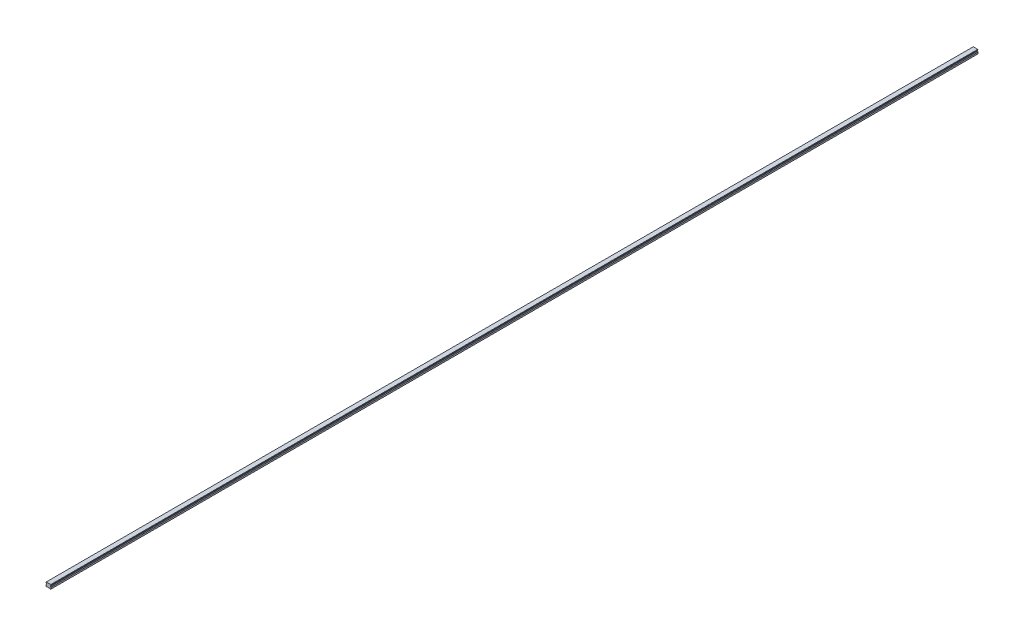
from build123d import *

# Parameters (mm, degrees)
SKETCH1_W           = 20
SKETCH1_H           = 16.3
BOSS_EXTRUDE1_DEPTH = 1850
CUT_EXTRUDE1_DEPTH  = 3701.049417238
CHAMFER1_SIZE       = 1
FILLET1_R           = 1
CUT_EXTRUDE2_DEPTH  = 3701.049417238
SKETCH5_R           = 3
SKETCH5_R_2         = 2.5
CUT_EXTRUDE5_DEPTH  = 10
SKETCH5_2_R         = 2.5
CUT_EXTRUDE6_DEPTH  = 13
LPATTERN2_COUNT     = 62
LPATTERN2_PITCH     = 60


with BuildPart() as part:
    # Sketch1 → Boss-Extrude1 (new, symmetric)
    with BuildSketch(Plane.XY):
        with Locations((0, 8.15)):
            Rectangle(SKETCH1_W, SKETCH1_H)
    extrude(amount=BOSS_EXTRUDE1_DEPTH, both=True)

    # Sketch2 → Cut-Extrude1 (cut, through all)
    with BuildSketch(Plane.XY.offset(1850)):
        Polygon((-10, 14.3), (-10, 7.3), (-7.666666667, 9.633333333), (-7.666666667, 11.966666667), align=None)
        Polygon((7.666666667, 11.966666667), (10, 14.3), (10, 7.3), (7.666666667, 9.633333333), align=None)
    extrude(amount=-CUT_EXTRUDE1_DEPTH, mode=Mode.SUBTRACT)

    # Chamfer1
    chamfer1_edges = [part.edges().sort_by_distance(p)[0] for p in [
        (-10, 16.3, 0),
        (10, 16.3, 0),
        (10, 0, 0),
        (-10, 0, 0),
    ]]
    chamfer(chamfer1_edges, length=CHAMFER1_SIZE)

    # Fillet1
    fillet1_edges = [part.edges().sort_by_distance(p)[0] for p in [
        (-7.666666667, 11.966666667, 0),
        (-7.666666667, 9.633333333, 0),
        (7.666666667, 9.633333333, 0),
        (7.666666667, 11.966666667, 0),
    ]]
    fillet(fillet1_edges, radius=FILLET1_R)

    # Sketch3 → Cut-Extrude2 (cut, through all)
    with BuildSketch(Plane.XY.offset(1850)):
        Polygon((-6, 0), (-5, 1), (5, 1), (6, 0), align=None)
    extrude(amount=-CUT_EXTRUDE2_DEPTH, mode=Mode.SUBTRACT)

    # Sketch5 → Cut-Extrude5 (cut)
    with BuildSketch(Plane.XZ.offset(-1)):
        with Locations(Location((0, 1830, 0), (0, 0, 270))):
            Circle(SKETCH5_R)
        with Locations(Location((0, 1830, 0), (0, 0, 270))):
            Circle(SKETCH5_R_2, mode=Mode.SUBTRACT)
    cut_extrude5 = extrude(amount=-CUT_EXTRUDE5_DEPTH, mode=Mode.SUBTRACT)

    # Sketch5_2 → Cut-Extrude6 (cut)
    with BuildSketch(Plane.XZ.offset(-1)):
        with Locations(Location((0, 1830, 0), (0, 0, 270))):
            Circle(SKETCH5_2_R)
    cut_extrude6 = extrude(amount=-CUT_EXTRUDE6_DEPTH, mode=Mode.SUBTRACT)

    # Cut-Extrude7 cone 1 section (on through the dimple's axis) → Cut-Extrude7 (revolve, cut)
    with BuildSketch(Plane(origin=(0, 14, 1830), x_dir=(0, 0, -1), z_dir=(1, 0, 0))):
        Polygon((0, 0), (2.5, 0), (0, 1.443375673), align=None)
    cut_extrude7 = revolve(axis=Axis((0, 14, 1830), (0, 1, 0)), mode=Mode.SUBTRACT)

    # LPattern2: Cut-Extrude5, Cut-Extrude6, Cut-Extrude7 ×62
    with Locations(*[(0, 0, -i * LPATTERN2_PITCH) for i in range(1, LPATTERN2_COUNT)]):
        add(cut_extrude5, mode=Mode.SUBTRACT)
        add(cut_extrude6, mode=Mode.SUBTRACT)
        add(cut_extrude7, mode=Mode.SUBTRACT)


solid = part.part
